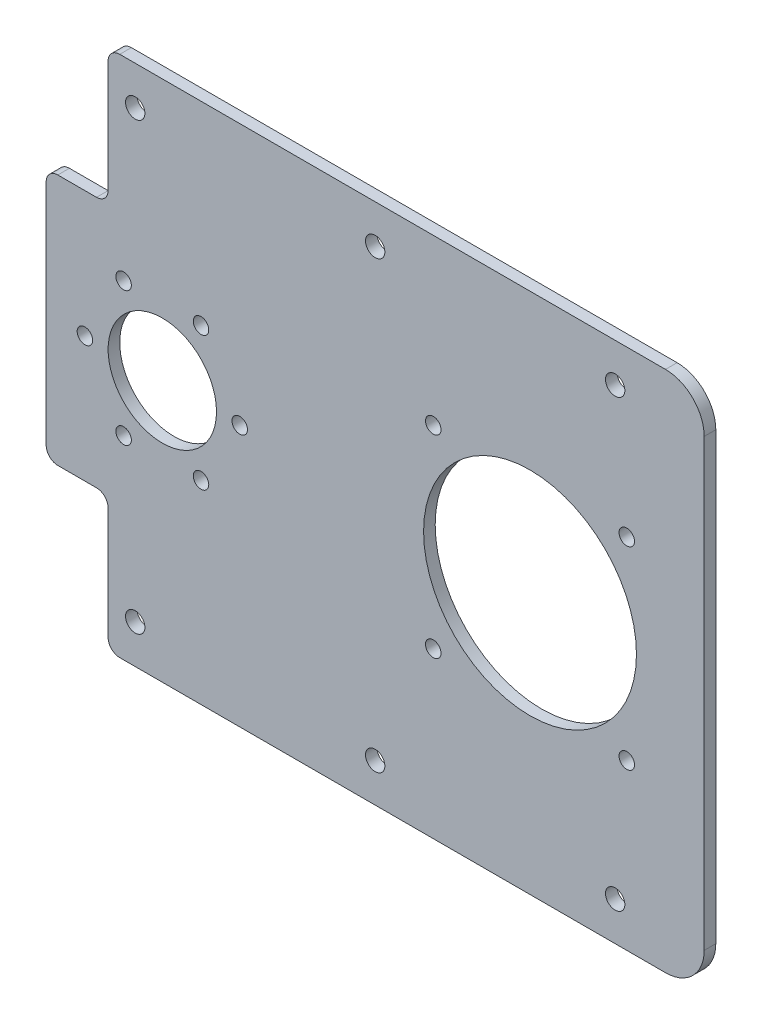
ISO-10303-21;
HEADER;
FILE_DESCRIPTION(('STEP AP214'),'2;1');
FILE_NAME('part.step','',(''),(''),'','','');
FILE_SCHEMA(('AUTOMOTIVE_DESIGN { 1 0 10303 214 1 1 1 1 }'));
ENDSEC;
DATA;
#1=APPLICATION_CONTEXT('core data for automotive mechanical design processes');
#2=APPLICATION_PROTOCOL_DEFINITION('international standard','automotive_design',2000,#1);
#3=PRODUCT_CONTEXT('',#1,'mechanical');
#4=PRODUCT('Part','Part','',(#3));
#5=PRODUCT_RELATED_PRODUCT_CATEGORY('part','',(#4));
#6=PRODUCT_DEFINITION_FORMATION('','',#4);
#7=PRODUCT_DEFINITION_CONTEXT('part definition',#1,'design');
#8=PRODUCT_DEFINITION('design','',#6,#7);
#9=PRODUCT_DEFINITION_SHAPE('','',#8);
#10=(LENGTH_UNIT() NAMED_UNIT(*) SI_UNIT(.MILLI.,.METRE.));
#11=(NAMED_UNIT(*) PLANE_ANGLE_UNIT() SI_UNIT($,.RADIAN.));
#12=(NAMED_UNIT(*) SI_UNIT($,.STERADIAN.) SOLID_ANGLE_UNIT());
#13=UNCERTAINTY_MEASURE_WITH_UNIT(LENGTH_MEASURE(1.E-05),#10,'distance_accuracy_value','');
#14=(GEOMETRIC_REPRESENTATION_CONTEXT(3) GLOBAL_UNCERTAINTY_ASSIGNED_CONTEXT((#13)) GLOBAL_UNIT_ASSIGNED_CONTEXT((#10,
#11,#12)) REPRESENTATION_CONTEXT('',''));
#15=CARTESIAN_POINT('',(0.,0.,0.));
#16=DIRECTION('',(0.,0.,1.));
#17=DIRECTION('',(1.,0.,0.));
#18=AXIS2_PLACEMENT_3D('',#15,#16,#17);
#19=CARTESIAN_POINT('',(0.,0.,1.5));
#20=DIRECTION('',(0.,0.,-1.));
#21=DIRECTION('',(-1.,0.,0.));
#22=AXIS2_PLACEMENT_3D('',#19,#20,#21);
#23=PLANE('',#22);
#24=CARTESIAN_POINT('',(62.,-57.5,1.5));
#25=DIRECTION('',(0.,0.,1.));
#26=DIRECTION('',(-1.,0.,0.));
#27=AXIS2_PLACEMENT_3D('',#24,#25,#26);
#28=CIRCLE('',#27,2.5);
#29=CARTESIAN_POINT('',(59.5,-57.5,1.5));
#30=VERTEX_POINT('',#29);
#31=EDGE_CURVE('E300',#30,#30,#28,.T.);
#32=ORIENTED_EDGE('',*,*,#31,.F.);
#33=EDGE_LOOP('',(#32));
#34=FACE_BOUND('',#33,.T.);
#35=CARTESIAN_POINT('',(-35.,0.,1.5));
#36=DIRECTION('',(0.,0.,1.));
#37=DIRECTION('',(1.,0.,0.));
#38=AXIS2_PLACEMENT_3D('',#35,#36,#37);
#39=CIRCLE('',#38,2.);
#40=CARTESIAN_POINT('',(-33.,0.,1.5));
#41=VERTEX_POINT('',#40);
#42=EDGE_CURVE('E306',#41,#41,#39,.T.);
#43=ORIENTED_EDGE('',*,*,#42,.F.);
#44=EDGE_LOOP('',(#43));
#45=FACE_BOUND('',#44,.T.);
#46=CARTESIAN_POINT('',(-45.,17.3205080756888,1.5));
#47=DIRECTION('',(0.,0.,1.));
#48=DIRECTION('',(1.,0.,0.));
#49=AXIS2_PLACEMENT_3D('',#46,#47,#48);
#50=CIRCLE('',#49,2.);
#51=CARTESIAN_POINT('',(-43.,17.3205080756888,1.5));
#52=VERTEX_POINT('',#51);
#53=EDGE_CURVE('E284',#52,#52,#50,.T.);
#54=ORIENTED_EDGE('',*,*,#53,.F.);
#55=EDGE_LOOP('',(#54));
#56=FACE_BOUND('',#55,.T.);
#57=CARTESIAN_POINT('',(-45.,-17.3205080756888,1.5));
#58=DIRECTION('',(0.,0.,1.));
#59=DIRECTION('',(1.,0.,0.));
#60=AXIS2_PLACEMENT_3D('',#57,#58,#59);
#61=CIRCLE('',#60,2.);
#62=CARTESIAN_POINT('',(-43.,-17.3205080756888,1.5));
#63=VERTEX_POINT('',#62);
#64=EDGE_CURVE('E285',#63,#63,#61,.T.);
#65=ORIENTED_EDGE('',*,*,#64,.F.);
#66=EDGE_LOOP('',(#65));
#67=FACE_BOUND('',#66,.T.);
#68=CARTESIAN_POINT('',(-65.0000000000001,-17.3205080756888,1.5));
#69=DIRECTION('',(0.,0.,1.));
#70=DIRECTION('',(1.,0.,0.));
#71=AXIS2_PLACEMENT_3D('',#68,#69,#70);
#72=CIRCLE('',#71,2.00000000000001);
#73=CARTESIAN_POINT('',(-63.0000000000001,-17.3205080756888,1.5));
#74=VERTEX_POINT('',#73);
#75=EDGE_CURVE('E291',#74,#74,#72,.T.);
#76=ORIENTED_EDGE('',*,*,#75,.F.);
#77=EDGE_LOOP('',(#76));
#78=FACE_BOUND('',#77,.T.);
#79=CARTESIAN_POINT('',(-64.9999999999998,17.3205080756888,1.5));
#80=DIRECTION('',(0.,0.,1.));
#81=DIRECTION('',(1.,0.,0.));
#82=AXIS2_PLACEMENT_3D('',#79,#80,#81);
#83=CIRCLE('',#82,2.);
#84=CARTESIAN_POINT('',(-62.9999999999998,17.3205080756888,1.5));
#85=VERTEX_POINT('',#84);
#86=EDGE_CURVE('E273',#85,#85,#83,.T.);
#87=ORIENTED_EDGE('',*,*,#86,.F.);
#88=EDGE_LOOP('',(#87));
#89=FACE_BOUND('',#88,.T.);
#90=CARTESIAN_POINT('',(0.,-57.5,1.5));
#91=DIRECTION('',(0.,0.,1.));
#92=DIRECTION('',(-1.,0.,0.));
#93=AXIS2_PLACEMENT_3D('',#90,#91,#92);
#94=CIRCLE('',#93,2.5);
#95=CARTESIAN_POINT('',(-2.49999999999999,-57.5,1.5));
#96=VERTEX_POINT('',#95);
#97=EDGE_CURVE('E299',#96,#96,#94,.T.);
#98=ORIENTED_EDGE('',*,*,#97,.F.);
#99=EDGE_LOOP('',(#98));
#100=FACE_BOUND('',#99,.T.);
#101=CARTESIAN_POINT('',(-62.,-57.5,1.5));
#102=DIRECTION('',(0.,0.,1.));
#103=DIRECTION('',(-1.,0.,0.));
#104=AXIS2_PLACEMENT_3D('',#101,#102,#103);
#105=CIRCLE('',#104,2.50000000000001);
#106=CARTESIAN_POINT('',(-64.5,-57.5,1.5));
#107=VERTEX_POINT('',#106);
#108=EDGE_CURVE('E336',#107,#107,#105,.T.);
#109=ORIENTED_EDGE('',*,*,#108,.F.);
#110=EDGE_LOOP('',(#109));
#111=FACE_BOUND('',#110,.T.);
#112=CARTESIAN_POINT('',(-75.,0.,1.5));
#113=DIRECTION('',(0.,0.,1.));
#114=DIRECTION('',(1.,0.,0.));
#115=AXIS2_PLACEMENT_3D('',#112,#113,#114);
#116=CIRCLE('',#115,2.);
#117=CARTESIAN_POINT('',(-73.,0.,1.5));
#118=VERTEX_POINT('',#117);
#119=EDGE_CURVE('E330',#118,#118,#116,.T.);
#120=ORIENTED_EDGE('',*,*,#119,.F.);
#121=EDGE_LOOP('',(#120));
#122=FACE_BOUND('',#121,.T.);
#123=CARTESIAN_POINT('',(-62.,57.5,1.5));
#124=DIRECTION('',(0.,0.,1.));
#125=DIRECTION('',(1.,0.,0.));
#126=AXIS2_PLACEMENT_3D('',#123,#124,#125);
#127=CIRCLE('',#126,2.5);
#128=CARTESIAN_POINT('',(-59.5,57.5,1.5));
#129=VERTEX_POINT('',#128);
#130=EDGE_CURVE('E324',#129,#129,#127,.T.);
#131=ORIENTED_EDGE('',*,*,#130,.F.);
#132=EDGE_LOOP('',(#131));
#133=FACE_BOUND('',#132,.T.);
#134=CARTESIAN_POINT('',(0.,57.5,1.5));
#135=DIRECTION('',(0.,0.,1.));
#136=DIRECTION('',(1.,0.,0.));
#137=AXIS2_PLACEMENT_3D('',#134,#135,#136);
#138=CIRCLE('',#137,2.5);
#139=CARTESIAN_POINT('',(2.5,57.5,1.5));
#140=VERTEX_POINT('',#139);
#141=EDGE_CURVE('E318',#140,#140,#138,.T.);
#142=ORIENTED_EDGE('',*,*,#141,.F.);
#143=EDGE_LOOP('',(#142));
#144=FACE_BOUND('',#143,.T.);
#145=CARTESIAN_POINT('',(62.,57.5,1.5));
#146=DIRECTION('',(0.,0.,1.));
#147=DIRECTION('',(1.,0.,0.));
#148=AXIS2_PLACEMENT_3D('',#145,#146,#147);
#149=CIRCLE('',#148,2.5);
#150=CARTESIAN_POINT('',(64.5,57.5,1.5));
#151=VERTEX_POINT('',#150);
#152=EDGE_CURVE('E317',#151,#151,#149,.T.);
#153=ORIENTED_EDGE('',*,*,#152,.F.);
#154=EDGE_LOOP('',(#153));
#155=FACE_BOUND('',#154,.T.);
#156=CARTESIAN_POINT('',(15.,25.,1.5));
#157=DIRECTION('',(0.,0.,1.));
#158=DIRECTION('',(1.,0.,0.));
#159=AXIS2_PLACEMENT_3D('',#156,#157,#158);
#160=CIRCLE('',#159,2.);
#161=CARTESIAN_POINT('',(17.,25.,1.5));
#162=VERTEX_POINT('',#161);
#163=EDGE_CURVE('E347',#162,#162,#160,.T.);
#164=ORIENTED_EDGE('',*,*,#163,.F.);
#165=EDGE_LOOP('',(#164));
#166=FACE_BOUND('',#165,.T.);
#167=CARTESIAN_POINT('',(65.,25.,1.5));
#168=DIRECTION('',(0.,0.,1.));
#169=DIRECTION('',(1.,0.,0.));
#170=AXIS2_PLACEMENT_3D('',#167,#168,#169);
#171=CIRCLE('',#170,2.);
#172=CARTESIAN_POINT('',(67.,25.,1.5));
#173=VERTEX_POINT('',#172);
#174=EDGE_CURVE('E355',#173,#173,#171,.T.);
#175=ORIENTED_EDGE('',*,*,#174,.F.);
#176=EDGE_LOOP('',(#175));
#177=FACE_BOUND('',#176,.T.);
#178=CARTESIAN_POINT('',(15.,-25.,1.5));
#179=DIRECTION('',(0.,0.,1.));
#180=DIRECTION('',(1.,0.,0.));
#181=AXIS2_PLACEMENT_3D('',#178,#179,#180);
#182=CIRCLE('',#181,2.);
#183=CARTESIAN_POINT('',(17.,-25.,1.5));
#184=VERTEX_POINT('',#183);
#185=EDGE_CURVE('E361',#184,#184,#182,.T.);
#186=ORIENTED_EDGE('',*,*,#185,.F.);
#187=EDGE_LOOP('',(#186));
#188=FACE_BOUND('',#187,.T.);
#189=CARTESIAN_POINT('',(65.,-25.,1.5));
#190=DIRECTION('',(0.,0.,1.));
#191=DIRECTION('',(1.,0.,0.));
#192=AXIS2_PLACEMENT_3D('',#189,#190,#191);
#193=CIRCLE('',#192,2.);
#194=CARTESIAN_POINT('',(67.,-25.,1.5));
#195=VERTEX_POINT('',#194);
#196=EDGE_CURVE('E367',#195,#195,#193,.T.);
#197=ORIENTED_EDGE('',*,*,#196,.F.);
#198=EDGE_LOOP('',(#197));
#199=FACE_BOUND('',#198,.T.);
#200=CARTESIAN_POINT('',(40.,0.,1.5));
#201=DIRECTION('',(0.,0.,1.));
#202=DIRECTION('',(1.,0.,0.));
#203=AXIS2_PLACEMENT_3D('',#200,#201,#202);
#204=CIRCLE('',#203,27.5);
#205=CARTESIAN_POINT('',(67.5,0.,1.5));
#206=VERTEX_POINT('',#205);
#207=EDGE_CURVE('E373',#206,#206,#204,.T.);
#208=ORIENTED_EDGE('',*,*,#207,.F.);
#209=EDGE_LOOP('',(#208));
#210=FACE_BOUND('',#209,.T.);
#211=DIRECTION('',(-1.,0.,0.));
#212=VECTOR('',#211,1.);
#213=CARTESIAN_POINT('',(-85.,67.5,1.5));
#214=LINE('',#213,#212);
#215=CARTESIAN_POINT('',(75.0000000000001,67.5,1.5));
#216=VERTEX_POINT('',#215);
#217=CARTESIAN_POINT('',(-66.,67.5,1.5));
#218=VERTEX_POINT('',#217);
#219=EDGE_CURVE('E171',#216,#218,#214,.T.);
#220=ORIENTED_EDGE('',*,*,#219,.T.);
#221=CARTESIAN_POINT('',(-66.,64.5,1.5));
#222=DIRECTION('',(0.,0.,-1.));
#223=DIRECTION('',(-1.,0.,0.));
#224=AXIS2_PLACEMENT_3D('',#221,#222,#223);
#225=CIRCLE('',#224,3.);
#226=CARTESIAN_POINT('',(-69.,64.5,1.5));
#227=VERTEX_POINT('',#226);
#228=EDGE_CURVE('E210',#218,#227,#225,.F.);
#229=ORIENTED_EDGE('',*,*,#228,.T.);
#230=DIRECTION('',(0.,1.,0.));
#231=VECTOR('',#230,1.);
#232=CARTESIAN_POINT('',(-69.,32.5,1.5));
#233=LINE('',#232,#231);
#234=CARTESIAN_POINT('',(-69.,35.5,1.5));
#235=VERTEX_POINT('',#234);
#236=EDGE_CURVE('E462',#235,#227,#233,.T.);
#237=ORIENTED_EDGE('',*,*,#236,.F.);
#238=CARTESIAN_POINT('',(-72.,35.5,1.5));
#239=DIRECTION('',(0.,0.,-1.));
#240=DIRECTION('',(-1.,0.,0.));
#241=AXIS2_PLACEMENT_3D('',#238,#239,#240);
#242=CIRCLE('',#241,3.);
#243=CARTESIAN_POINT('',(-72.,32.5,1.5));
#244=VERTEX_POINT('',#243);
#245=EDGE_CURVE('E243',#235,#244,#242,.T.);
#246=ORIENTED_EDGE('',*,*,#245,.T.);
#247=DIRECTION('',(1.,0.,0.));
#248=VECTOR('',#247,1.);
#249=CARTESIAN_POINT('',(-85.,32.5,1.5));
#250=LINE('',#249,#248);
#251=CARTESIAN_POINT('',(-82.,32.5,1.5));
#252=VERTEX_POINT('',#251);
#253=EDGE_CURVE('E471',#252,#244,#250,.T.);
#254=ORIENTED_EDGE('',*,*,#253,.F.);
#255=CARTESIAN_POINT('',(-82.,29.5,1.5));
#256=DIRECTION('',(0.,0.,-1.));
#257=DIRECTION('',(-1.,0.,0.));
#258=AXIS2_PLACEMENT_3D('',#255,#256,#257);
#259=CIRCLE('',#258,3.);
#260=CARTESIAN_POINT('',(-85.,29.5,1.5));
#261=VERTEX_POINT('',#260);
#262=EDGE_CURVE('E208',#252,#261,#259,.F.);
#263=ORIENTED_EDGE('',*,*,#262,.T.);
#264=DIRECTION('',(0.,-1.,0.));
#265=VECTOR('',#264,1.);
#266=CARTESIAN_POINT('',(-85.,-67.5,1.5));
#267=LINE('',#266,#265);
#268=CARTESIAN_POINT('',(-85.,-29.5,1.5));
#269=VERTEX_POINT('',#268);
#270=EDGE_CURVE('E387',#261,#269,#267,.T.);
#271=ORIENTED_EDGE('',*,*,#270,.T.);
#272=CARTESIAN_POINT('',(-82.,-29.5,1.5));
#273=DIRECTION('',(0.,0.,-1.));
#274=DIRECTION('',(-1.,0.,0.));
#275=AXIS2_PLACEMENT_3D('',#272,#273,#274);
#276=CIRCLE('',#275,3.);
#277=CARTESIAN_POINT('',(-82.,-32.5,1.5));
#278=VERTEX_POINT('',#277);
#279=EDGE_CURVE('E204',#269,#278,#276,.F.);
#280=ORIENTED_EDGE('',*,*,#279,.T.);
#281=DIRECTION('',(-1.,0.,0.));
#282=VECTOR('',#281,1.);
#283=CARTESIAN_POINT('',(-85.,-32.5,1.5));
#284=LINE('',#283,#282);
#285=CARTESIAN_POINT('',(-72.,-32.5,1.5));
#286=VERTEX_POINT('',#285);
#287=EDGE_CURVE('E254',#286,#278,#284,.T.);
#288=ORIENTED_EDGE('',*,*,#287,.F.);
#289=CARTESIAN_POINT('',(-72.,-35.5,1.5));
#290=DIRECTION('',(0.,0.,-1.));
#291=DIRECTION('',(-1.,0.,0.));
#292=AXIS2_PLACEMENT_3D('',#289,#290,#291);
#293=CIRCLE('',#292,3.);
#294=CARTESIAN_POINT('',(-69.,-35.5,1.5));
#295=VERTEX_POINT('',#294);
#296=EDGE_CURVE('E44',#286,#295,#293,.T.);
#297=ORIENTED_EDGE('',*,*,#296,.T.);
#298=DIRECTION('',(0.,1.,0.));
#299=VECTOR('',#298,1.);
#300=CARTESIAN_POINT('',(-69.,-32.5,1.5));
#301=LINE('',#300,#299);
#302=CARTESIAN_POINT('',(-69.,-64.5,1.5));
#303=VERTEX_POINT('',#302);
#304=EDGE_CURVE('E251',#303,#295,#301,.T.);
#305=ORIENTED_EDGE('',*,*,#304,.F.);
#306=CARTESIAN_POINT('',(-66.,-64.5,1.5));
#307=DIRECTION('',(0.,0.,-1.));
#308=DIRECTION('',(-1.,0.,0.));
#309=AXIS2_PLACEMENT_3D('',#306,#307,#308);
#310=CIRCLE('',#309,3.);
#311=CARTESIAN_POINT('',(-66.,-67.5,1.5));
#312=VERTEX_POINT('',#311);
#313=EDGE_CURVE('E206',#303,#312,#310,.F.);
#314=ORIENTED_EDGE('',*,*,#313,.T.);
#315=DIRECTION('',(1.,0.,0.));
#316=VECTOR('',#315,1.);
#317=CARTESIAN_POINT('',(-85.,-67.5,1.5));
#318=LINE('',#317,#316);
#319=CARTESIAN_POINT('',(75.0000000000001,-67.5,1.5));
#320=VERTEX_POINT('',#319);
#321=EDGE_CURVE('E172',#312,#320,#318,.T.);
#322=ORIENTED_EDGE('',*,*,#321,.T.);
#323=CARTESIAN_POINT('',(75.,-57.5,1.5));
#324=DIRECTION('',(0.,0.,-1.));
#325=DIRECTION('',(-1.,0.,0.));
#326=AXIS2_PLACEMENT_3D('',#323,#324,#325);
#327=CIRCLE('',#326,10.);
#328=CARTESIAN_POINT('',(85.,-57.5,1.5));
#329=VERTEX_POINT('',#328);
#330=EDGE_CURVE('E195',#320,#329,#327,.F.);
#331=ORIENTED_EDGE('',*,*,#330,.T.);
#332=DIRECTION('',(0.,1.,0.));
#333=VECTOR('',#332,1.);
#334=CARTESIAN_POINT('',(85.,-67.5,1.5));
#335=LINE('',#334,#333);
#336=CARTESIAN_POINT('',(85.,57.5,1.5));
#337=VERTEX_POINT('',#336);
#338=EDGE_CURVE('E188',#329,#337,#335,.T.);
#339=ORIENTED_EDGE('',*,*,#338,.T.);
#340=CARTESIAN_POINT('',(75.0000000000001,57.5,1.5));
#341=DIRECTION('',(0.,0.,-1.));
#342=DIRECTION('',(-1.,0.,0.));
#343=AXIS2_PLACEMENT_3D('',#340,#341,#342);
#344=CIRCLE('',#343,10.);
#345=EDGE_CURVE('E197',#337,#216,#344,.F.);
#346=ORIENTED_EDGE('',*,*,#345,.T.);
#347=EDGE_LOOP('',(#220,#229,#237,#246,#254,#263,#271,#280,#288,#297,#305,#314,#322,#331,#339,#346));
#348=FACE_BOUND('',#347,.T.);
#349=CARTESIAN_POINT('',(-55.,0.,1.5));
#350=DIRECTION('',(0.,0.,1.));
#351=DIRECTION('',(1.,0.,0.));
#352=AXIS2_PLACEMENT_3D('',#349,#350,#351);
#353=CIRCLE('',#352,14.);
#354=CARTESIAN_POINT('',(-41.,0.,1.5));
#355=VERTEX_POINT('',#354);
#356=EDGE_CURVE('E184',#355,#355,#353,.T.);
#357=ORIENTED_EDGE('',*,*,#356,.F.);
#358=EDGE_LOOP('',(#357));
#359=FACE_BOUND('',#358,.T.);
#360=ADVANCED_FACE('F36',(#34,#45,#56,#67,#78,#89,#100,#111,#122,#133,#144,#155,#166,#177,#188,
#199,#210,#348,#359),#23,.F.);
#361=CARTESIAN_POINT('',(0.,0.,-1.5));
#362=DIRECTION('',(0.,0.,-1.));
#363=DIRECTION('',(-1.,0.,0.));
#364=AXIS2_PLACEMENT_3D('',#361,#362,#363);
#365=PLANE('',#364);
#366=DIRECTION('',(0.,-1.,0.));
#367=VECTOR('',#366,1.);
#368=CARTESIAN_POINT('',(-69.,0.,-1.5));
#369=LINE('',#368,#367);
#370=CARTESIAN_POINT('',(-69.,64.5,-1.5));
#371=VERTEX_POINT('',#370);
#372=CARTESIAN_POINT('',(-69.,35.5,-1.5));
#373=VERTEX_POINT('',#372);
#374=EDGE_CURVE('E263',#371,#373,#369,.T.);
#375=ORIENTED_EDGE('',*,*,#374,.F.);
#376=CARTESIAN_POINT('',(-66.,64.5,-1.5));
#377=DIRECTION('',(0.,0.,-1.));
#378=DIRECTION('',(-1.,0.,0.));
#379=AXIS2_PLACEMENT_3D('',#376,#377,#378);
#380=CIRCLE('',#379,3.);
#381=CARTESIAN_POINT('',(-66.,67.5,-1.5));
#382=VERTEX_POINT('',#381);
#383=EDGE_CURVE('E178',#371,#382,#380,.T.);
#384=ORIENTED_EDGE('',*,*,#383,.T.);
#385=DIRECTION('',(-1.,0.,0.));
#386=VECTOR('',#385,1.);
#387=CARTESIAN_POINT('',(-85.,67.5,-1.5));
#388=LINE('',#387,#386);
#389=CARTESIAN_POINT('',(75.0000000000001,67.5,-1.5));
#390=VERTEX_POINT('',#389);
#391=EDGE_CURVE('E168',#390,#382,#388,.T.);
#392=ORIENTED_EDGE('',*,*,#391,.F.);
#393=CARTESIAN_POINT('',(75.0000000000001,57.5,-1.5));
#394=DIRECTION('',(0.,0.,-1.));
#395=DIRECTION('',(-1.,0.,0.));
#396=AXIS2_PLACEMENT_3D('',#393,#394,#395);
#397=CIRCLE('',#396,10.);
#398=CARTESIAN_POINT('',(85.,57.5,-1.5));
#399=VERTEX_POINT('',#398);
#400=EDGE_CURVE('E151',#390,#399,#397,.T.);
#401=ORIENTED_EDGE('',*,*,#400,.T.);
#402=DIRECTION('',(0.,1.,0.));
#403=VECTOR('',#402,1.);
#404=CARTESIAN_POINT('',(85.,-67.5,-1.5));
#405=LINE('',#404,#403);
#406=CARTESIAN_POINT('',(85.,-57.5,-1.5));
#407=VERTEX_POINT('',#406);
#408=EDGE_CURVE('E180',#407,#399,#405,.T.);
#409=ORIENTED_EDGE('',*,*,#408,.F.);
#410=CARTESIAN_POINT('',(75.,-57.5,-1.5));
#411=DIRECTION('',(0.,0.,-1.));
#412=DIRECTION('',(-1.,0.,0.));
#413=AXIS2_PLACEMENT_3D('',#410,#411,#412);
#414=CIRCLE('',#413,10.);
#415=CARTESIAN_POINT('',(75.0000000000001,-67.5,-1.5));
#416=VERTEX_POINT('',#415);
#417=EDGE_CURVE('E161',#407,#416,#414,.T.);
#418=ORIENTED_EDGE('',*,*,#417,.T.);
#419=DIRECTION('',(1.,0.,0.));
#420=VECTOR('',#419,1.);
#421=CARTESIAN_POINT('',(-85.,-67.5,-1.5));
#422=LINE('',#421,#420);
#423=CARTESIAN_POINT('',(-66.,-67.5,-1.5));
#424=VERTEX_POINT('',#423);
#425=EDGE_CURVE('E182',#424,#416,#422,.T.);
#426=ORIENTED_EDGE('',*,*,#425,.F.);
#427=CARTESIAN_POINT('',(-66.,-64.5,-1.5));
#428=DIRECTION('',(0.,0.,-1.));
#429=DIRECTION('',(-1.,0.,0.));
#430=AXIS2_PLACEMENT_3D('',#427,#428,#429);
#431=CIRCLE('',#430,3.);
#432=CARTESIAN_POINT('',(-69.,-64.5,-1.5));
#433=VERTEX_POINT('',#432);
#434=EDGE_CURVE('E218',#424,#433,#431,.T.);
#435=ORIENTED_EDGE('',*,*,#434,.T.);
#436=DIRECTION('',(0.,-1.,0.));
#437=VECTOR('',#436,1.);
#438=CARTESIAN_POINT('',(-69.,0.,-1.5));
#439=LINE('',#438,#437);
#440=CARTESIAN_POINT('',(-69.,-35.5,-1.5));
#441=VERTEX_POINT('',#440);
#442=EDGE_CURVE('E269',#441,#433,#439,.T.);
#443=ORIENTED_EDGE('',*,*,#442,.F.);
#444=CARTESIAN_POINT('',(-72.,-35.5,-1.5));
#445=DIRECTION('',(0.,0.,-1.));
#446=DIRECTION('',(-1.,0.,0.));
#447=AXIS2_PLACEMENT_3D('',#444,#445,#446);
#448=CIRCLE('',#447,3.);
#449=CARTESIAN_POINT('',(-72.,-32.5,-1.5));
#450=VERTEX_POINT('',#449);
#451=EDGE_CURVE('E11',#441,#450,#448,.F.);
#452=ORIENTED_EDGE('',*,*,#451,.T.);
#453=DIRECTION('',(1.,0.,0.));
#454=VECTOR('',#453,1.);
#455=CARTESIAN_POINT('',(0.,-32.5,-1.5));
#456=LINE('',#455,#454);
#457=CARTESIAN_POINT('',(-82.,-32.5,-1.5));
#458=VERTEX_POINT('',#457);
#459=EDGE_CURVE('E268',#458,#450,#456,.T.);
#460=ORIENTED_EDGE('',*,*,#459,.F.);
#461=CARTESIAN_POINT('',(-82.,-29.5,-1.5));
#462=DIRECTION('',(0.,0.,-1.));
#463=DIRECTION('',(-1.,0.,0.));
#464=AXIS2_PLACEMENT_3D('',#461,#462,#463);
#465=CIRCLE('',#464,3.);
#466=CARTESIAN_POINT('',(-85.,-29.5,-1.5));
#467=VERTEX_POINT('',#466);
#468=EDGE_CURVE('E51',#458,#467,#465,.T.);
#469=ORIENTED_EDGE('',*,*,#468,.T.);
#470=DIRECTION('',(0.,-1.,0.));
#471=VECTOR('',#470,1.);
#472=CARTESIAN_POINT('',(-85.,-67.5,-1.5));
#473=LINE('',#472,#471);
#474=CARTESIAN_POINT('',(-85.,29.5,-1.5));
#475=VERTEX_POINT('',#474);
#476=EDGE_CURVE('E179',#475,#467,#473,.T.);
#477=ORIENTED_EDGE('',*,*,#476,.F.);
#478=CARTESIAN_POINT('',(-82.,29.5,-1.5));
#479=DIRECTION('',(0.,0.,-1.));
#480=DIRECTION('',(-1.,0.,0.));
#481=AXIS2_PLACEMENT_3D('',#478,#479,#480);
#482=CIRCLE('',#481,3.);
#483=CARTESIAN_POINT('',(-82.,32.5,-1.5));
#484=VERTEX_POINT('',#483);
#485=EDGE_CURVE('E59',#475,#484,#482,.T.);
#486=ORIENTED_EDGE('',*,*,#485,.T.);
#487=DIRECTION('',(-1.,0.,0.));
#488=VECTOR('',#487,1.);
#489=CARTESIAN_POINT('',(0.,32.5,-1.5));
#490=LINE('',#489,#488);
#491=CARTESIAN_POINT('',(-72.,32.5,-1.5));
#492=VERTEX_POINT('',#491);
#493=EDGE_CURVE('E456',#492,#484,#490,.T.);
#494=ORIENTED_EDGE('',*,*,#493,.F.);
#495=CARTESIAN_POINT('',(-72.,35.5,-1.5));
#496=DIRECTION('',(0.,0.,-1.));
#497=DIRECTION('',(-1.,0.,0.));
#498=AXIS2_PLACEMENT_3D('',#495,#496,#497);
#499=CIRCLE('',#498,3.);
#500=EDGE_CURVE('E245',#492,#373,#499,.F.);
#501=ORIENTED_EDGE('',*,*,#500,.T.);
#502=EDGE_LOOP('',(#375,#384,#392,#401,#409,#418,#426,#435,#443,#452,#460,#469,#477,#486,#494,#501));
#503=FACE_BOUND('',#502,.T.);
#504=CARTESIAN_POINT('',(62.,-57.5,-1.5));
#505=DIRECTION('',(0.,0.,1.));
#506=DIRECTION('',(-1.,0.,0.));
#507=AXIS2_PLACEMENT_3D('',#504,#505,#506);
#508=CIRCLE('',#507,2.5);
#509=CARTESIAN_POINT('',(59.5,-57.5,-1.5));
#510=VERTEX_POINT('',#509);
#511=EDGE_CURVE('E296',#510,#510,#508,.T.);
#512=ORIENTED_EDGE('',*,*,#511,.T.);
#513=EDGE_LOOP('',(#512));
#514=FACE_BOUND('',#513,.T.);
#515=CARTESIAN_POINT('',(-35.,0.,-1.5));
#516=DIRECTION('',(0.,0.,1.));
#517=DIRECTION('',(1.,0.,0.));
#518=AXIS2_PLACEMENT_3D('',#515,#516,#517);
#519=CIRCLE('',#518,2.);
#520=CARTESIAN_POINT('',(-33.,0.,-1.5));
#521=VERTEX_POINT('',#520);
#522=EDGE_CURVE('E303',#521,#521,#519,.T.);
#523=ORIENTED_EDGE('',*,*,#522,.T.);
#524=EDGE_LOOP('',(#523));
#525=FACE_BOUND('',#524,.T.);
#526=CARTESIAN_POINT('',(-45.,17.3205080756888,-1.5));
#527=DIRECTION('',(0.,0.,1.));
#528=DIRECTION('',(1.,0.,0.));
#529=AXIS2_PLACEMENT_3D('',#526,#527,#528);
#530=CIRCLE('',#529,2.);
#531=CARTESIAN_POINT('',(-43.,17.3205080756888,-1.5));
#532=VERTEX_POINT('',#531);
#533=EDGE_CURVE('E309',#532,#532,#530,.T.);
#534=ORIENTED_EDGE('',*,*,#533,.T.);
#535=EDGE_LOOP('',(#534));
#536=FACE_BOUND('',#535,.T.);
#537=CARTESIAN_POINT('',(-45.,-17.3205080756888,-1.5));
#538=DIRECTION('',(0.,0.,1.));
#539=DIRECTION('',(1.,0.,0.));
#540=AXIS2_PLACEMENT_3D('',#537,#538,#539);
#541=CIRCLE('',#540,2.);
#542=CARTESIAN_POINT('',(-43.,-17.3205080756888,-1.5));
#543=VERTEX_POINT('',#542);
#544=EDGE_CURVE('E281',#543,#543,#541,.T.);
#545=ORIENTED_EDGE('',*,*,#544,.T.);
#546=EDGE_LOOP('',(#545));
#547=FACE_BOUND('',#546,.T.);
#548=CARTESIAN_POINT('',(-65.0000000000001,-17.3205080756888,-1.5));
#549=DIRECTION('',(0.,0.,1.));
#550=DIRECTION('',(1.,0.,0.));
#551=AXIS2_PLACEMENT_3D('',#548,#549,#550);
#552=CIRCLE('',#551,2.00000000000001);
#553=CARTESIAN_POINT('',(-63.0000000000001,-17.3205080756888,-1.5));
#554=VERTEX_POINT('',#553);
#555=EDGE_CURVE('E288',#554,#554,#552,.T.);
#556=ORIENTED_EDGE('',*,*,#555,.T.);
#557=EDGE_LOOP('',(#556));
#558=FACE_BOUND('',#557,.T.);
#559=CARTESIAN_POINT('',(-64.9999999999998,17.3205080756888,-1.5));
#560=DIRECTION('',(0.,0.,1.));
#561=DIRECTION('',(1.,0.,0.));
#562=AXIS2_PLACEMENT_3D('',#559,#560,#561);
#563=CIRCLE('',#562,2.);
#564=CARTESIAN_POINT('',(-62.9999999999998,17.3205080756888,-1.5));
#565=VERTEX_POINT('',#564);
#566=EDGE_CURVE('E276',#565,#565,#563,.T.);
#567=ORIENTED_EDGE('',*,*,#566,.T.);
#568=EDGE_LOOP('',(#567));
#569=FACE_BOUND('',#568,.T.);
#570=CARTESIAN_POINT('',(0.,-57.5,-1.5));
#571=DIRECTION('',(0.,0.,1.));
#572=DIRECTION('',(-1.,0.,0.));
#573=AXIS2_PLACEMENT_3D('',#570,#571,#572);
#574=CIRCLE('',#573,2.5);
#575=CARTESIAN_POINT('',(-2.49999999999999,-57.5,-1.5));
#576=VERTEX_POINT('',#575);
#577=EDGE_CURVE('E339',#576,#576,#574,.T.);
#578=ORIENTED_EDGE('',*,*,#577,.T.);
#579=EDGE_LOOP('',(#578));
#580=FACE_BOUND('',#579,.T.);
#581=CARTESIAN_POINT('',(-62.,-57.5,-1.5));
#582=DIRECTION('',(0.,0.,1.));
#583=DIRECTION('',(-1.,0.,0.));
#584=AXIS2_PLACEMENT_3D('',#581,#582,#583);
#585=CIRCLE('',#584,2.50000000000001);
#586=CARTESIAN_POINT('',(-64.5,-57.5,-1.5));
#587=VERTEX_POINT('',#586);
#588=EDGE_CURVE('E333',#587,#587,#585,.T.);
#589=ORIENTED_EDGE('',*,*,#588,.T.);
#590=EDGE_LOOP('',(#589));
#591=FACE_BOUND('',#590,.T.);
#592=CARTESIAN_POINT('',(-75.,0.,-1.5));
#593=DIRECTION('',(0.,0.,1.));
#594=DIRECTION('',(1.,0.,0.));
#595=AXIS2_PLACEMENT_3D('',#592,#593,#594);
#596=CIRCLE('',#595,2.);
#597=CARTESIAN_POINT('',(-73.,0.,-1.5));
#598=VERTEX_POINT('',#597);
#599=EDGE_CURVE('E327',#598,#598,#596,.T.);
#600=ORIENTED_EDGE('',*,*,#599,.T.);
#601=EDGE_LOOP('',(#600));
#602=FACE_BOUND('',#601,.T.);
#603=CARTESIAN_POINT('',(-62.,57.5,-1.5));
#604=DIRECTION('',(0.,0.,1.));
#605=DIRECTION('',(1.,0.,0.));
#606=AXIS2_PLACEMENT_3D('',#603,#604,#605);
#607=CIRCLE('',#606,2.5);
#608=CARTESIAN_POINT('',(-59.5,57.5,-1.5));
#609=VERTEX_POINT('',#608);
#610=EDGE_CURVE('E321',#609,#609,#607,.T.);
#611=ORIENTED_EDGE('',*,*,#610,.T.);
#612=EDGE_LOOP('',(#611));
#613=FACE_BOUND('',#612,.T.);
#614=CARTESIAN_POINT('',(0.,57.5,-1.5));
#615=DIRECTION('',(0.,0.,1.));
#616=DIRECTION('',(1.,0.,0.));
#617=AXIS2_PLACEMENT_3D('',#614,#615,#616);
#618=CIRCLE('',#617,2.5);
#619=CARTESIAN_POINT('',(2.5,57.5,-1.5));
#620=VERTEX_POINT('',#619);
#621=EDGE_CURVE('E314',#620,#620,#618,.T.);
#622=ORIENTED_EDGE('',*,*,#621,.T.);
#623=EDGE_LOOP('',(#622));
#624=FACE_BOUND('',#623,.T.);
#625=CARTESIAN_POINT('',(62.,57.5,-1.5));
#626=DIRECTION('',(0.,0.,1.));
#627=DIRECTION('',(1.,0.,0.));
#628=AXIS2_PLACEMENT_3D('',#625,#626,#627);
#629=CIRCLE('',#628,2.5);
#630=CARTESIAN_POINT('',(64.5,57.5,-1.5));
#631=VERTEX_POINT('',#630);
#632=EDGE_CURVE('E344',#631,#631,#629,.T.);
#633=ORIENTED_EDGE('',*,*,#632,.T.);
#634=EDGE_LOOP('',(#633));
#635=FACE_BOUND('',#634,.T.);
#636=CARTESIAN_POINT('',(15.,25.,-1.5));
#637=DIRECTION('',(0.,0.,-1.));
#638=DIRECTION('',(-1.,0.,0.));
#639=AXIS2_PLACEMENT_3D('',#636,#637,#638);
#640=CIRCLE('',#639,2.);
#641=CARTESIAN_POINT('',(13.,25.,-1.5));
#642=VERTEX_POINT('',#641);
#643=EDGE_CURVE('E352',#642,#642,#640,.T.);
#644=ORIENTED_EDGE('',*,*,#643,.F.);
#645=EDGE_LOOP('',(#644));
#646=FACE_BOUND('',#645,.T.);
#647=CARTESIAN_POINT('',(65.,25.,-1.5));
#648=DIRECTION('',(0.,0.,-1.));
#649=DIRECTION('',(-1.,0.,0.));
#650=AXIS2_PLACEMENT_3D('',#647,#648,#649);
#651=CIRCLE('',#650,2.);
#652=CARTESIAN_POINT('',(63.,25.,-1.5));
#653=VERTEX_POINT('',#652);
#654=EDGE_CURVE('E358',#653,#653,#651,.T.);
#655=ORIENTED_EDGE('',*,*,#654,.F.);
#656=EDGE_LOOP('',(#655));
#657=FACE_BOUND('',#656,.T.);
#658=CARTESIAN_POINT('',(15.,-25.,-1.5));
#659=DIRECTION('',(0.,0.,-1.));
#660=DIRECTION('',(-1.,0.,0.));
#661=AXIS2_PLACEMENT_3D('',#658,#659,#660);
#662=CIRCLE('',#661,2.);
#663=CARTESIAN_POINT('',(13.,-25.,-1.5));
#664=VERTEX_POINT('',#663);
#665=EDGE_CURVE('E364',#664,#664,#662,.T.);
#666=ORIENTED_EDGE('',*,*,#665,.F.);
#667=EDGE_LOOP('',(#666));
#668=FACE_BOUND('',#667,.T.);
#669=CARTESIAN_POINT('',(65.,-25.,-1.5));
#670=DIRECTION('',(0.,0.,-1.));
#671=DIRECTION('',(-1.,0.,0.));
#672=AXIS2_PLACEMENT_3D('',#669,#670,#671);
#673=CIRCLE('',#672,2.);
#674=CARTESIAN_POINT('',(63.,-25.,-1.5));
#675=VERTEX_POINT('',#674);
#676=EDGE_CURVE('E370',#675,#675,#673,.T.);
#677=ORIENTED_EDGE('',*,*,#676,.F.);
#678=EDGE_LOOP('',(#677));
#679=FACE_BOUND('',#678,.T.);
#680=CARTESIAN_POINT('',(40.,0.,-1.5));
#681=DIRECTION('',(0.,0.,1.));
#682=DIRECTION('',(1.,0.,0.));
#683=AXIS2_PLACEMENT_3D('',#680,#681,#682);
#684=CIRCLE('',#683,27.5);
#685=CARTESIAN_POINT('',(67.5,0.,-1.5));
#686=VERTEX_POINT('',#685);
#687=EDGE_CURVE('E376',#686,#686,#684,.T.);
#688=ORIENTED_EDGE('',*,*,#687,.T.);
#689=EDGE_LOOP('',(#688));
#690=FACE_BOUND('',#689,.T.);
#691=CARTESIAN_POINT('',(-55.,0.,-1.5));
#692=DIRECTION('',(0.,0.,1.));
#693=DIRECTION('',(1.,0.,0.));
#694=AXIS2_PLACEMENT_3D('',#691,#692,#693);
#695=CIRCLE('',#694,14.);
#696=CARTESIAN_POINT('',(-41.,0.,-1.5));
#697=VERTEX_POINT('',#696);
#698=EDGE_CURVE('E379',#697,#697,#695,.T.);
#699=ORIENTED_EDGE('',*,*,#698,.T.);
#700=EDGE_LOOP('',(#699));
#701=FACE_BOUND('',#700,.T.);
#702=ADVANCED_FACE('F175',(#503,#514,#525,#536,#547,#558,#569,#580,#591,#602,#613,#624,#635,
#646,#657,#668,#679,#690,#701),#365,.T.);
#703=CARTESIAN_POINT('',(85.,-67.5,1.5));
#704=DIRECTION('',(-1.,0.,0.));
#705=DIRECTION('',(0.,0.,1.));
#706=AXIS2_PLACEMENT_3D('',#703,#704,#705);
#707=PLANE('',#706);
#708=ORIENTED_EDGE('',*,*,#408,.T.);
#709=DIRECTION('',(0.,0.,-1.));
#710=VECTOR('',#709,1.);
#711=CARTESIAN_POINT('',(85.,57.5,1.5));
#712=LINE('',#711,#710);
#713=EDGE_CURVE('E156',#399,#337,#712,.F.);
#714=ORIENTED_EDGE('',*,*,#713,.T.);
#715=ORIENTED_EDGE('',*,*,#338,.F.);
#716=DIRECTION('',(0.,0.,-1.));
#717=VECTOR('',#716,1.);
#718=CARTESIAN_POINT('',(85.,-57.5,1.5));
#719=LINE('',#718,#717);
#720=EDGE_CURVE('E160',#329,#407,#719,.T.);
#721=ORIENTED_EDGE('',*,*,#720,.T.);
#722=EDGE_LOOP('',(#708,#714,#715,#721));
#723=FACE_BOUND('',#722,.T.);
#724=ADVANCED_FACE('F401',(#723),#707,.F.);
#725=CARTESIAN_POINT('',(-85.,67.5,1.5));
#726=DIRECTION('',(0.,-1.,0.));
#727=DIRECTION('',(0.,0.,-1.));
#728=AXIS2_PLACEMENT_3D('',#725,#726,#727);
#729=PLANE('',#728);
#730=ORIENTED_EDGE('',*,*,#391,.T.);
#731=DIRECTION('',(0.,0.,1.));
#732=VECTOR('',#731,1.);
#733=CARTESIAN_POINT('',(-66.,67.5,1.5));
#734=LINE('',#733,#732);
#735=EDGE_CURVE('E202',#382,#218,#734,.T.);
#736=ORIENTED_EDGE('',*,*,#735,.T.);
#737=ORIENTED_EDGE('',*,*,#219,.F.);
#738=DIRECTION('',(0.,0.,-1.));
#739=VECTOR('',#738,1.);
#740=CARTESIAN_POINT('',(75.0000000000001,67.5,1.5));
#741=LINE('',#740,#739);
#742=EDGE_CURVE('E155',#216,#390,#741,.T.);
#743=ORIENTED_EDGE('',*,*,#742,.T.);
#744=EDGE_LOOP('',(#730,#736,#737,#743));
#745=FACE_BOUND('',#744,.T.);
#746=ADVANCED_FACE('F166',(#745),#729,.F.);
#747=CARTESIAN_POINT('',(-85.,-67.5,1.5));
#748=DIRECTION('',(1.,0.,0.));
#749=DIRECTION('',(0.,0.,-1.));
#750=AXIS2_PLACEMENT_3D('',#747,#748,#749);
#751=PLANE('',#750);
#752=ORIENTED_EDGE('',*,*,#270,.F.);
#753=DIRECTION('',(0.,0.,-1.));
#754=VECTOR('',#753,1.);
#755=CARTESIAN_POINT('',(-85.,29.5,1.5));
#756=LINE('',#755,#754);
#757=EDGE_CURVE('E229',#261,#475,#756,.T.);
#758=ORIENTED_EDGE('',*,*,#757,.T.);
#759=ORIENTED_EDGE('',*,*,#476,.T.);
#760=DIRECTION('',(0.,0.,1.));
#761=VECTOR('',#760,1.);
#762=CARTESIAN_POINT('',(-85.,-29.5,1.5));
#763=LINE('',#762,#761);
#764=EDGE_CURVE('E226',#467,#269,#763,.T.);
#765=ORIENTED_EDGE('',*,*,#764,.T.);
#766=EDGE_LOOP('',(#752,#758,#759,#765));
#767=FACE_BOUND('',#766,.T.);
#768=ADVANCED_FACE('F428',(#767),#751,.F.);
#769=CARTESIAN_POINT('',(-85.,-67.5,1.5));
#770=DIRECTION('',(0.,1.,0.));
#771=DIRECTION('',(0.,0.,1.));
#772=AXIS2_PLACEMENT_3D('',#769,#770,#771);
#773=PLANE('',#772);
#774=ORIENTED_EDGE('',*,*,#321,.F.);
#775=DIRECTION('',(0.,0.,-1.));
#776=VECTOR('',#775,1.);
#777=CARTESIAN_POINT('',(-66.,-67.5,1.5));
#778=LINE('',#777,#776);
#779=EDGE_CURVE('E231',#312,#424,#778,.T.);
#780=ORIENTED_EDGE('',*,*,#779,.T.);
#781=ORIENTED_EDGE('',*,*,#425,.T.);
#782=DIRECTION('',(0.,0.,-1.));
#783=VECTOR('',#782,1.);
#784=CARTESIAN_POINT('',(75.0000000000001,-67.5,1.5));
#785=LINE('',#784,#783);
#786=EDGE_CURVE('E199',#416,#320,#785,.F.);
#787=ORIENTED_EDGE('',*,*,#786,.T.);
#788=EDGE_LOOP('',(#774,#780,#781,#787));
#789=FACE_BOUND('',#788,.T.);
#790=ADVANCED_FACE('F395',(#789),#773,.F.);
#791=CARTESIAN_POINT('',(-55.,0.,1.5));
#792=DIRECTION('',(0.,0.,-1.));
#793=DIRECTION('',(-1.,0.,0.));
#794=AXIS2_PLACEMENT_3D('',#791,#792,#793);
#795=CYLINDRICAL_SURFACE('',#794,14.);
#796=ORIENTED_EDGE('',*,*,#356,.T.);
#797=EDGE_LOOP('',(#796));
#798=FACE_BOUND('',#797,.T.);
#799=ORIENTED_EDGE('',*,*,#698,.F.);
#800=EDGE_LOOP('',(#799));
#801=FACE_BOUND('',#800,.T.);
#802=ADVANCED_FACE('F423',(#798,#801),#795,.F.);
#803=CARTESIAN_POINT('',(40.,0.,-1.5));
#804=DIRECTION('',(0.,0.,1.));
#805=DIRECTION('',(1.,0.,0.));
#806=AXIS2_PLACEMENT_3D('',#803,#804,#805);
#807=CYLINDRICAL_SURFACE('',#806,27.5);
#808=ORIENTED_EDGE('',*,*,#687,.F.);
#809=EDGE_LOOP('',(#808));
#810=FACE_BOUND('',#809,.T.);
#811=ORIENTED_EDGE('',*,*,#207,.T.);
#812=EDGE_LOOP('',(#811));
#813=FACE_BOUND('',#812,.T.);
#814=ADVANCED_FACE('F547',(#810,#813),#807,.F.);
#815=CARTESIAN_POINT('',(65.,-25.,1.5));
#816=DIRECTION('',(0.,0.,1.));
#817=DIRECTION('',(1.,0.,0.));
#818=AXIS2_PLACEMENT_3D('',#815,#816,#817);
#819=CYLINDRICAL_SURFACE('',#818,2.);
#820=ORIENTED_EDGE('',*,*,#676,.T.);
#821=EDGE_LOOP('',(#820));
#822=FACE_BOUND('',#821,.T.);
#823=ORIENTED_EDGE('',*,*,#196,.T.);
#824=EDGE_LOOP('',(#823));
#825=FACE_BOUND('',#824,.T.);
#826=ADVANCED_FACE('F544',(#822,#825),#819,.F.);
#827=CARTESIAN_POINT('',(15.,-25.,1.5));
#828=DIRECTION('',(0.,0.,1.));
#829=DIRECTION('',(1.,0.,0.));
#830=AXIS2_PLACEMENT_3D('',#827,#828,#829);
#831=CYLINDRICAL_SURFACE('',#830,2.);
#832=ORIENTED_EDGE('',*,*,#665,.T.);
#833=EDGE_LOOP('',(#832));
#834=FACE_BOUND('',#833,.T.);
#835=ORIENTED_EDGE('',*,*,#185,.T.);
#836=EDGE_LOOP('',(#835));
#837=FACE_BOUND('',#836,.T.);
#838=ADVANCED_FACE('F540',(#834,#837),#831,.F.);
#839=CARTESIAN_POINT('',(65.,25.,1.5));
#840=DIRECTION('',(0.,0.,1.));
#841=DIRECTION('',(1.,0.,0.));
#842=AXIS2_PLACEMENT_3D('',#839,#840,#841);
#843=CYLINDRICAL_SURFACE('',#842,2.);
#844=ORIENTED_EDGE('',*,*,#654,.T.);
#845=EDGE_LOOP('',(#844));
#846=FACE_BOUND('',#845,.T.);
#847=ORIENTED_EDGE('',*,*,#174,.T.);
#848=EDGE_LOOP('',(#847));
#849=FACE_BOUND('',#848,.T.);
#850=ADVANCED_FACE('F536',(#846,#849),#843,.F.);
#851=CARTESIAN_POINT('',(15.,25.,1.5));
#852=DIRECTION('',(0.,0.,1.));
#853=DIRECTION('',(1.,0.,0.));
#854=AXIS2_PLACEMENT_3D('',#851,#852,#853);
#855=CYLINDRICAL_SURFACE('',#854,2.);
#856=ORIENTED_EDGE('',*,*,#643,.T.);
#857=EDGE_LOOP('',(#856));
#858=FACE_BOUND('',#857,.T.);
#859=ORIENTED_EDGE('',*,*,#163,.T.);
#860=EDGE_LOOP('',(#859));
#861=FACE_BOUND('',#860,.T.);
#862=ADVANCED_FACE('F532',(#858,#861),#855,.F.);
#863=CARTESIAN_POINT('',(62.,57.5,-1.5));
#864=DIRECTION('',(0.,0.,1.));
#865=DIRECTION('',(1.,0.,0.));
#866=AXIS2_PLACEMENT_3D('',#863,#864,#865);
#867=CYLINDRICAL_SURFACE('',#866,2.5);
#868=ORIENTED_EDGE('',*,*,#632,.F.);
#869=EDGE_LOOP('',(#868));
#870=FACE_BOUND('',#869,.T.);
#871=ORIENTED_EDGE('',*,*,#152,.T.);
#872=EDGE_LOOP('',(#871));
#873=FACE_BOUND('',#872,.T.);
#874=ADVANCED_FACE('F514',(#870,#873),#867,.F.);
#875=CARTESIAN_POINT('',(0.,57.5,-1.5));
#876=DIRECTION('',(0.,0.,1.));
#877=DIRECTION('',(1.,0.,0.));
#878=AXIS2_PLACEMENT_3D('',#875,#876,#877);
#879=CYLINDRICAL_SURFACE('',#878,2.5);
#880=ORIENTED_EDGE('',*,*,#621,.F.);
#881=EDGE_LOOP('',(#880));
#882=FACE_BOUND('',#881,.T.);
#883=ORIENTED_EDGE('',*,*,#141,.T.);
#884=EDGE_LOOP('',(#883));
#885=FACE_BOUND('',#884,.T.);
#886=ADVANCED_FACE('F510',(#882,#885),#879,.F.);
#887=CARTESIAN_POINT('',(-62.,57.5,-1.5));
#888=DIRECTION('',(0.,0.,1.));
#889=DIRECTION('',(1.,0.,0.));
#890=AXIS2_PLACEMENT_3D('',#887,#888,#889);
#891=CYLINDRICAL_SURFACE('',#890,2.5);
#892=ORIENTED_EDGE('',*,*,#610,.F.);
#893=EDGE_LOOP('',(#892));
#894=FACE_BOUND('',#893,.T.);
#895=ORIENTED_EDGE('',*,*,#130,.T.);
#896=EDGE_LOOP('',(#895));
#897=FACE_BOUND('',#896,.T.);
#898=ADVANCED_FACE('F513',(#894,#897),#891,.F.);
#899=CARTESIAN_POINT('',(-75.,0.,-1.5));
#900=DIRECTION('',(0.,0.,1.));
#901=DIRECTION('',(1.,0.,0.));
#902=AXIS2_PLACEMENT_3D('',#899,#900,#901);
#903=CYLINDRICAL_SURFACE('',#902,2.);
#904=ORIENTED_EDGE('',*,*,#599,.F.);
#905=EDGE_LOOP('',(#904));
#906=FACE_BOUND('',#905,.T.);
#907=ORIENTED_EDGE('',*,*,#119,.T.);
#908=EDGE_LOOP('',(#907));
#909=FACE_BOUND('',#908,.T.);
#910=ADVANCED_FACE('F518',(#906,#909),#903,.F.);
#911=CARTESIAN_POINT('',(-62.,-57.5,-1.5));
#912=DIRECTION('',(0.,0.,1.));
#913=DIRECTION('',(1.,0.,0.));
#914=AXIS2_PLACEMENT_3D('',#911,#912,#913);
#915=CYLINDRICAL_SURFACE('',#914,2.50000000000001);
#916=ORIENTED_EDGE('',*,*,#588,.F.);
#917=EDGE_LOOP('',(#916));
#918=FACE_BOUND('',#917,.T.);
#919=ORIENTED_EDGE('',*,*,#108,.T.);
#920=EDGE_LOOP('',(#919));
#921=FACE_BOUND('',#920,.T.);
#922=ADVANCED_FACE('F522',(#918,#921),#915,.F.);
#923=CARTESIAN_POINT('',(0.,-57.5,-1.5));
#924=DIRECTION('',(0.,0.,1.));
#925=DIRECTION('',(1.,0.,0.));
#926=AXIS2_PLACEMENT_3D('',#923,#924,#925);
#927=CYLINDRICAL_SURFACE('',#926,2.5);
#928=ORIENTED_EDGE('',*,*,#577,.F.);
#929=EDGE_LOOP('',(#928));
#930=FACE_BOUND('',#929,.T.);
#931=ORIENTED_EDGE('',*,*,#97,.T.);
#932=EDGE_LOOP('',(#931));
#933=FACE_BOUND('',#932,.T.);
#934=ADVANCED_FACE('F498',(#930,#933),#927,.F.);
#935=CARTESIAN_POINT('',(-64.9999999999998,17.3205080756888,-1.5));
#936=DIRECTION('',(0.,0.,1.));
#937=DIRECTION('',(1.,0.,0.));
#938=AXIS2_PLACEMENT_3D('',#935,#936,#937);
#939=CYLINDRICAL_SURFACE('',#938,2.);
#940=ORIENTED_EDGE('',*,*,#566,.F.);
#941=EDGE_LOOP('',(#940));
#942=FACE_BOUND('',#941,.T.);
#943=ORIENTED_EDGE('',*,*,#86,.T.);
#944=EDGE_LOOP('',(#943));
#945=FACE_BOUND('',#944,.T.);
#946=ADVANCED_FACE('F494',(#942,#945),#939,.F.);
#947=CARTESIAN_POINT('',(-65.0000000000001,-17.3205080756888,-1.5));
#948=DIRECTION('',(0.,0.,1.));
#949=DIRECTION('',(1.,0.,0.));
#950=AXIS2_PLACEMENT_3D('',#947,#948,#949);
#951=CYLINDRICAL_SURFACE('',#950,2.00000000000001);
#952=ORIENTED_EDGE('',*,*,#555,.F.);
#953=EDGE_LOOP('',(#952));
#954=FACE_BOUND('',#953,.T.);
#955=ORIENTED_EDGE('',*,*,#75,.T.);
#956=EDGE_LOOP('',(#955));
#957=FACE_BOUND('',#956,.T.);
#958=ADVANCED_FACE('F490',(#954,#957),#951,.F.);
#959=CARTESIAN_POINT('',(-45.,-17.3205080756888,-1.5));
#960=DIRECTION('',(0.,0.,1.));
#961=DIRECTION('',(1.,0.,0.));
#962=AXIS2_PLACEMENT_3D('',#959,#960,#961);
#963=CYLINDRICAL_SURFACE('',#962,2.);
#964=ORIENTED_EDGE('',*,*,#544,.F.);
#965=EDGE_LOOP('',(#964));
#966=FACE_BOUND('',#965,.T.);
#967=ORIENTED_EDGE('',*,*,#64,.T.);
#968=EDGE_LOOP('',(#967));
#969=FACE_BOUND('',#968,.T.);
#970=ADVANCED_FACE('F486',(#966,#969),#963,.F.);
#971=CARTESIAN_POINT('',(-45.,17.3205080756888,-1.5));
#972=DIRECTION('',(0.,0.,1.));
#973=DIRECTION('',(1.,0.,0.));
#974=AXIS2_PLACEMENT_3D('',#971,#972,#973);
#975=CYLINDRICAL_SURFACE('',#974,2.);
#976=ORIENTED_EDGE('',*,*,#533,.F.);
#977=EDGE_LOOP('',(#976));
#978=FACE_BOUND('',#977,.T.);
#979=ORIENTED_EDGE('',*,*,#53,.T.);
#980=EDGE_LOOP('',(#979));
#981=FACE_BOUND('',#980,.T.);
#982=ADVANCED_FACE('F489',(#978,#981),#975,.F.);
#983=CARTESIAN_POINT('',(-35.,0.,-1.5));
#984=DIRECTION('',(0.,0.,1.));
#985=DIRECTION('',(1.,0.,0.));
#986=AXIS2_PLACEMENT_3D('',#983,#984,#985);
#987=CYLINDRICAL_SURFACE('',#986,2.);
#988=ORIENTED_EDGE('',*,*,#522,.F.);
#989=EDGE_LOOP('',(#988));
#990=FACE_BOUND('',#989,.T.);
#991=ORIENTED_EDGE('',*,*,#42,.T.);
#992=EDGE_LOOP('',(#991));
#993=FACE_BOUND('',#992,.T.);
#994=ADVANCED_FACE('F502',(#990,#993),#987,.F.);
#995=CARTESIAN_POINT('',(62.,-57.5,-1.5));
#996=DIRECTION('',(0.,0.,1.));
#997=DIRECTION('',(1.,0.,0.));
#998=AXIS2_PLACEMENT_3D('',#995,#996,#997);
#999=CYLINDRICAL_SURFACE('',#998,2.5);
#1000=ORIENTED_EDGE('',*,*,#511,.F.);
#1001=EDGE_LOOP('',(#1000));
#1002=FACE_BOUND('',#1001,.T.);
#1003=ORIENTED_EDGE('',*,*,#31,.T.);
#1004=EDGE_LOOP('',(#1003));
#1005=FACE_BOUND('',#1004,.T.);
#1006=ADVANCED_FACE('F438',(#1002,#1005),#999,.F.);
#1007=CARTESIAN_POINT('',(75.0000000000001,57.5,1.5));
#1008=DIRECTION('',(0.,0.,-1.));
#1009=DIRECTION('',(-1.,0.,0.));
#1010=AXIS2_PLACEMENT_3D('',#1007,#1008,#1009);
#1011=CYLINDRICAL_SURFACE('',#1010,10.);
#1012=ORIENTED_EDGE('',*,*,#345,.F.);
#1013=ORIENTED_EDGE('',*,*,#713,.F.);
#1014=ORIENTED_EDGE('',*,*,#400,.F.);
#1015=ORIENTED_EDGE('',*,*,#742,.F.);
#1016=EDGE_LOOP('',(#1012,#1013,#1014,#1015));
#1017=FACE_BOUND('',#1016,.T.);
#1018=ADVANCED_FACE('F154',(#1017),#1011,.T.);
#1019=CARTESIAN_POINT('',(75.,-57.5,1.5));
#1020=DIRECTION('',(0.,0.,-1.));
#1021=DIRECTION('',(-1.,0.,0.));
#1022=AXIS2_PLACEMENT_3D('',#1019,#1020,#1021);
#1023=CYLINDRICAL_SURFACE('',#1022,10.);
#1024=ORIENTED_EDGE('',*,*,#330,.F.);
#1025=ORIENTED_EDGE('',*,*,#786,.F.);
#1026=ORIENTED_EDGE('',*,*,#417,.F.);
#1027=ORIENTED_EDGE('',*,*,#720,.F.);
#1028=EDGE_LOOP('',(#1024,#1025,#1026,#1027));
#1029=FACE_BOUND('',#1028,.T.);
#1030=ADVANCED_FACE('F399',(#1029),#1023,.T.);
#1031=CARTESIAN_POINT('',(-85.,-32.5,-8.5));
#1032=DIRECTION('',(0.,1.,0.));
#1033=DIRECTION('',(0.,0.,1.));
#1034=AXIS2_PLACEMENT_3D('',#1031,#1032,#1033);
#1035=PLANE('',#1034);
#1036=ORIENTED_EDGE('',*,*,#459,.T.);
#1037=DIRECTION('',(0.,0.,1.));
#1038=VECTOR('',#1037,1.);
#1039=CARTESIAN_POINT('',(-72.,-32.5,1.5));
#1040=LINE('',#1039,#1038);
#1041=EDGE_CURVE('E240',#450,#286,#1040,.T.);
#1042=ORIENTED_EDGE('',*,*,#1041,.T.);
#1043=ORIENTED_EDGE('',*,*,#287,.T.);
#1044=DIRECTION('',(0.,0.,1.));
#1045=VECTOR('',#1044,1.);
#1046=CARTESIAN_POINT('',(-82.,-32.5,-8.5));
#1047=LINE('',#1046,#1045);
#1048=EDGE_CURVE('E238',#278,#458,#1047,.F.);
#1049=ORIENTED_EDGE('',*,*,#1048,.T.);
#1050=EDGE_LOOP('',(#1036,#1042,#1043,#1049));
#1051=FACE_BOUND('',#1050,.T.);
#1052=ADVANCED_FACE('F271',(#1051),#1035,.F.);
#1053=CARTESIAN_POINT('',(-69.,-32.5,-8.5));
#1054=DIRECTION('',(1.,0.,0.));
#1055=DIRECTION('',(0.,1.,0.));
#1056=AXIS2_PLACEMENT_3D('',#1053,#1054,#1055);
#1057=PLANE('',#1056);
#1058=ORIENTED_EDGE('',*,*,#442,.T.);
#1059=DIRECTION('',(0.,0.,-1.));
#1060=VECTOR('',#1059,1.);
#1061=CARTESIAN_POINT('',(-69.,-64.5,-8.5));
#1062=LINE('',#1061,#1060);
#1063=EDGE_CURVE('E236',#433,#303,#1062,.F.);
#1064=ORIENTED_EDGE('',*,*,#1063,.T.);
#1065=ORIENTED_EDGE('',*,*,#304,.T.);
#1066=DIRECTION('',(0.,0.,1.));
#1067=VECTOR('',#1066,1.);
#1068=CARTESIAN_POINT('',(-69.,-35.5,-1.5));
#1069=LINE('',#1068,#1067);
#1070=EDGE_CURVE('E234',#295,#441,#1069,.F.);
#1071=ORIENTED_EDGE('',*,*,#1070,.T.);
#1072=EDGE_LOOP('',(#1058,#1064,#1065,#1071));
#1073=FACE_BOUND('',#1072,.T.);
#1074=ADVANCED_FACE('F260',(#1073),#1057,.F.);
#1075=CARTESIAN_POINT('',(-85.,32.5,-8.5));
#1076=DIRECTION('',(0.,-1.,0.));
#1077=DIRECTION('',(0.,0.,-1.));
#1078=AXIS2_PLACEMENT_3D('',#1075,#1076,#1077);
#1079=PLANE('',#1078);
#1080=ORIENTED_EDGE('',*,*,#253,.T.);
#1081=DIRECTION('',(0.,0.,1.));
#1082=VECTOR('',#1081,1.);
#1083=CARTESIAN_POINT('',(-72.,32.5,-1.5));
#1084=LINE('',#1083,#1082);
#1085=EDGE_CURVE('E224',#244,#492,#1084,.F.);
#1086=ORIENTED_EDGE('',*,*,#1085,.T.);
#1087=ORIENTED_EDGE('',*,*,#493,.T.);
#1088=DIRECTION('',(0.,0.,-1.));
#1089=VECTOR('',#1088,1.);
#1090=CARTESIAN_POINT('',(-82.,32.5,-8.5));
#1091=LINE('',#1090,#1089);
#1092=EDGE_CURVE('E222',#484,#252,#1091,.F.);
#1093=ORIENTED_EDGE('',*,*,#1092,.T.);
#1094=EDGE_LOOP('',(#1080,#1086,#1087,#1093));
#1095=FACE_BOUND('',#1094,.T.);
#1096=ADVANCED_FACE('F473',(#1095),#1079,.F.);
#1097=CARTESIAN_POINT('',(-69.,32.5,-8.5));
#1098=DIRECTION('',(1.,0.,0.));
#1099=DIRECTION('',(0.,1.,0.));
#1100=AXIS2_PLACEMENT_3D('',#1097,#1098,#1099);
#1101=PLANE('',#1100);
#1102=ORIENTED_EDGE('',*,*,#236,.T.);
#1103=DIRECTION('',(0.,0.,1.));
#1104=VECTOR('',#1103,1.);
#1105=CARTESIAN_POINT('',(-69.,64.5,-8.5));
#1106=LINE('',#1105,#1104);
#1107=EDGE_CURVE('E215',#227,#371,#1106,.F.);
#1108=ORIENTED_EDGE('',*,*,#1107,.T.);
#1109=ORIENTED_EDGE('',*,*,#374,.T.);
#1110=DIRECTION('',(0.,0.,1.));
#1111=VECTOR('',#1110,1.);
#1112=CARTESIAN_POINT('',(-69.,35.5,1.5));
#1113=LINE('',#1112,#1111);
#1114=EDGE_CURVE('E212',#373,#235,#1113,.T.);
#1115=ORIENTED_EDGE('',*,*,#1114,.T.);
#1116=EDGE_LOOP('',(#1102,#1108,#1109,#1115));
#1117=FACE_BOUND('',#1116,.T.);
#1118=ADVANCED_FACE('F444',(#1117),#1101,.F.);
#1119=CARTESIAN_POINT('',(-66.,64.5,1.5));
#1120=DIRECTION('',(0.,0.,1.));
#1121=DIRECTION('',(1.,0.,0.));
#1122=AXIS2_PLACEMENT_3D('',#1119,#1120,#1121);
#1123=CYLINDRICAL_SURFACE('',#1122,3.);
#1124=ORIENTED_EDGE('',*,*,#383,.F.);
#1125=ORIENTED_EDGE('',*,*,#1107,.F.);
#1126=ORIENTED_EDGE('',*,*,#228,.F.);
#1127=ORIENTED_EDGE('',*,*,#735,.F.);
#1128=EDGE_LOOP('',(#1124,#1125,#1126,#1127));
#1129=FACE_BOUND('',#1128,.T.);
#1130=ADVANCED_FACE('F441',(#1129),#1123,.T.);
#1131=CARTESIAN_POINT('',(-72.,35.5,-8.5));
#1132=DIRECTION('',(0.,0.,-1.));
#1133=DIRECTION('',(-1.,0.,0.));
#1134=AXIS2_PLACEMENT_3D('',#1131,#1132,#1133);
#1135=CYLINDRICAL_SURFACE('',#1134,3.);
#1136=ORIENTED_EDGE('',*,*,#500,.F.);
#1137=ORIENTED_EDGE('',*,*,#1085,.F.);
#1138=ORIENTED_EDGE('',*,*,#245,.F.);
#1139=ORIENTED_EDGE('',*,*,#1114,.F.);
#1140=EDGE_LOOP('',(#1136,#1137,#1138,#1139));
#1141=FACE_BOUND('',#1140,.T.);
#1142=ADVANCED_FACE('F411',(#1141),#1135,.F.);
#1143=CARTESIAN_POINT('',(-82.,29.5,1.5));
#1144=DIRECTION('',(0.,0.,-1.));
#1145=DIRECTION('',(-1.,0.,0.));
#1146=AXIS2_PLACEMENT_3D('',#1143,#1144,#1145);
#1147=CYLINDRICAL_SURFACE('',#1146,3.);
#1148=ORIENTED_EDGE('',*,*,#262,.F.);
#1149=ORIENTED_EDGE('',*,*,#1092,.F.);
#1150=ORIENTED_EDGE('',*,*,#485,.F.);
#1151=ORIENTED_EDGE('',*,*,#757,.F.);
#1152=EDGE_LOOP('',(#1148,#1149,#1150,#1151));
#1153=FACE_BOUND('',#1152,.T.);
#1154=ADVANCED_FACE('F405',(#1153),#1147,.T.);
#1155=CARTESIAN_POINT('',(-66.,-64.5,1.5));
#1156=DIRECTION('',(0.,0.,-1.));
#1157=DIRECTION('',(-1.,0.,0.));
#1158=AXIS2_PLACEMENT_3D('',#1155,#1156,#1157);
#1159=CYLINDRICAL_SURFACE('',#1158,3.);
#1160=ORIENTED_EDGE('',*,*,#313,.F.);
#1161=ORIENTED_EDGE('',*,*,#1063,.F.);
#1162=ORIENTED_EDGE('',*,*,#434,.F.);
#1163=ORIENTED_EDGE('',*,*,#779,.F.);
#1164=EDGE_LOOP('',(#1160,#1161,#1162,#1163));
#1165=FACE_BOUND('',#1164,.T.);
#1166=ADVANCED_FACE('F403',(#1165),#1159,.T.);
#1167=CARTESIAN_POINT('',(-72.,-35.5,-8.5));
#1168=DIRECTION('',(0.,0.,-1.));
#1169=DIRECTION('',(-1.,0.,0.));
#1170=AXIS2_PLACEMENT_3D('',#1167,#1168,#1169);
#1171=CYLINDRICAL_SURFACE('',#1170,3.);
#1172=ORIENTED_EDGE('',*,*,#451,.F.);
#1173=ORIENTED_EDGE('',*,*,#1070,.F.);
#1174=ORIENTED_EDGE('',*,*,#296,.F.);
#1175=ORIENTED_EDGE('',*,*,#1041,.F.);
#1176=EDGE_LOOP('',(#1172,#1173,#1174,#1175));
#1177=FACE_BOUND('',#1176,.T.);
#1178=ADVANCED_FACE('F266',(#1177),#1171,.F.);
#1179=CARTESIAN_POINT('',(-82.,-29.5,1.5));
#1180=DIRECTION('',(0.,0.,1.));
#1181=DIRECTION('',(1.,0.,0.));
#1182=AXIS2_PLACEMENT_3D('',#1179,#1180,#1181);
#1183=CYLINDRICAL_SURFACE('',#1182,3.);
#1184=ORIENTED_EDGE('',*,*,#468,.F.);
#1185=ORIENTED_EDGE('',*,*,#1048,.F.);
#1186=ORIENTED_EDGE('',*,*,#279,.F.);
#1187=ORIENTED_EDGE('',*,*,#764,.F.);
#1188=EDGE_LOOP('',(#1184,#1185,#1186,#1187));
#1189=FACE_BOUND('',#1188,.T.);
#1190=ADVANCED_FACE('F38',(#1189),#1183,.T.);
#1191=CLOSED_SHELL('',(#360,#702,#724,#746,#768,#790,#802,#814,#826,#838,#850,#862,#874,#886,
#898,#910,#922,#934,#946,#958,#970,#982,#994,#1006,#1018,#1030,#1052,#1074,#1096,#1118,#1130,
#1142,#1154,#1166,#1178,#1190));
#1192=MANIFOLD_SOLID_BREP('B2',#1191);
#1193=ADVANCED_BREP_SHAPE_REPRESENTATION('',(#18,#1192),#14);
#1194=SHAPE_DEFINITION_REPRESENTATION(#9,#1193);
ENDSEC;
END-ISO-10303-21;
